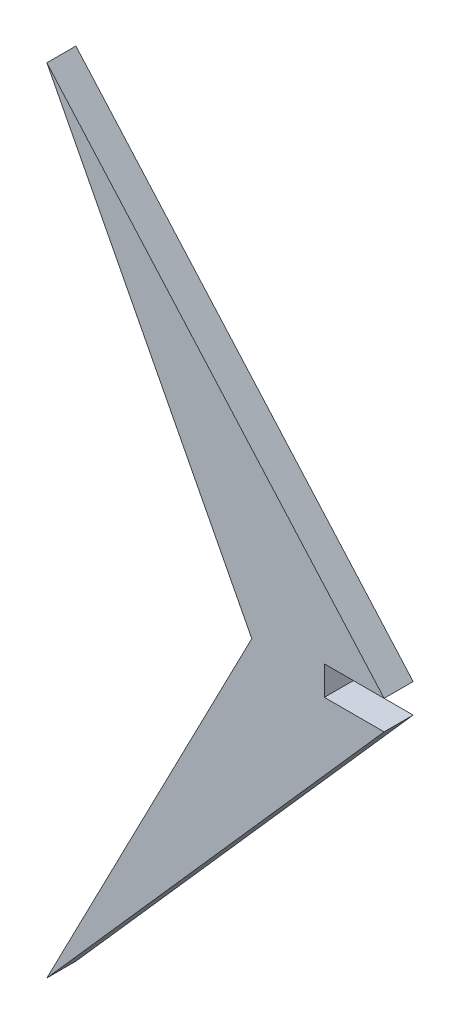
from build123d import *

# Parameters (mm, degrees)
EXTRUDE_1_DEPTH = 6


with BuildPart() as part:
    # Model → Extrude 1 (new body)
    with BuildSketch(Plane.XY):
        Polygon((142.642356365, 181.915204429), (185, 100), (142.642356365, 18.084795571), (212.35002882, 97), (200, 97), (200, 103), (212.35002882, 103), align=None)
    extrude(amount=EXTRUDE_1_DEPTH)


solid = part.part
